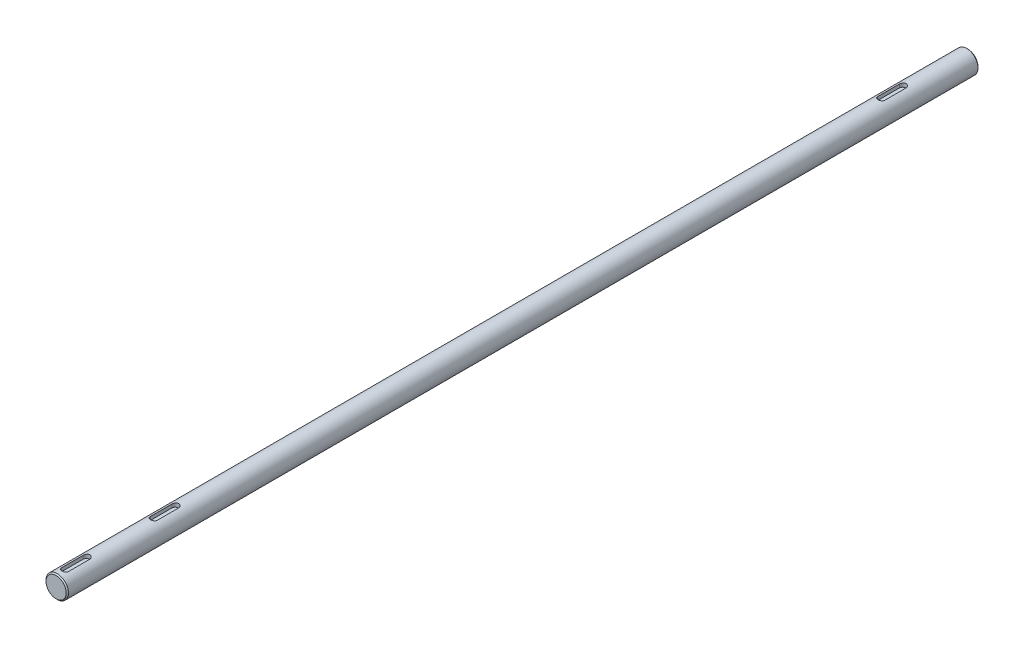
ISO-10303-21;
HEADER;
FILE_DESCRIPTION(('STEP AP214'),'2;1');
FILE_NAME('part.step','',(''),(''),'','','');
FILE_SCHEMA(('AUTOMOTIVE_DESIGN { 1 0 10303 214 1 1 1 1 }'));
ENDSEC;
DATA;
#1=APPLICATION_CONTEXT('core data for automotive mechanical design processes');
#2=APPLICATION_PROTOCOL_DEFINITION('international standard','automotive_design',2000,#1);
#3=PRODUCT_CONTEXT('',#1,'mechanical');
#4=PRODUCT('Part','Part','',(#3));
#5=PRODUCT_RELATED_PRODUCT_CATEGORY('part','',(#4));
#6=PRODUCT_DEFINITION_FORMATION('','',#4);
#7=PRODUCT_DEFINITION_CONTEXT('part definition',#1,'design');
#8=PRODUCT_DEFINITION('design','',#6,#7);
#9=PRODUCT_DEFINITION_SHAPE('','',#8);
#10=(LENGTH_UNIT() NAMED_UNIT(*) SI_UNIT(.MILLI.,.METRE.));
#11=(NAMED_UNIT(*) PLANE_ANGLE_UNIT() SI_UNIT($,.RADIAN.));
#12=(NAMED_UNIT(*) SI_UNIT($,.STERADIAN.) SOLID_ANGLE_UNIT());
#13=UNCERTAINTY_MEASURE_WITH_UNIT(LENGTH_MEASURE(1.E-05),#10,'distance_accuracy_value','');
#14=(GEOMETRIC_REPRESENTATION_CONTEXT(3) GLOBAL_UNCERTAINTY_ASSIGNED_CONTEXT((#13)) GLOBAL_UNIT_ASSIGNED_CONTEXT((#10,
#11,#12)) REPRESENTATION_CONTEXT('',''));
#15=CARTESIAN_POINT('',(0.,0.,0.));
#16=DIRECTION('',(0.,0.,1.));
#17=DIRECTION('',(1.,0.,0.));
#18=AXIS2_PLACEMENT_3D('',#15,#16,#17);
#19=CARTESIAN_POINT('',(-2.22044604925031E-13,1.66533453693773E-13,405.5));
#20=DIRECTION('',(0.,0.,-1.));
#21=DIRECTION('',(-1.00000000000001,0.,0.));
#22=AXIS2_PLACEMENT_3D('',#19,#20,#21);
#23=CYLINDRICAL_SURFACE('',#22,10.);
#24=DIRECTION('',(0.,0.,-1.));
#25=VECTOR('',#24,1.);
#26=CARTESIAN_POINT('',(2.99999999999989,9.53939201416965,405.5));
#27=LINE('',#26,#25);
#28=CARTESIAN_POINT('',(3.00000000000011,9.53939201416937,-347.5));
#29=VERTEX_POINT('',#28);
#30=CARTESIAN_POINT('',(2.99999999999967,9.53939201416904,-328.5));
#31=VERTEX_POINT('',#30);
#32=EDGE_CURVE('E11',#29,#31,#27,.F.);
#33=ORIENTED_EDGE('',*,*,#32,.T.);
#34=CARTESIAN_POINT('',(2.99999999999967,9.53939201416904,-328.5));
#35=CARTESIAN_POINT('',(3.00001027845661,9.53938054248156,-328.417664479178));
#36=CARTESIAN_POINT('',(2.99661062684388,9.54045772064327,-328.335335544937));
#37=CARTESIAN_POINT('',(2.98307142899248,9.54470412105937,-328.171306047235));
#38=CARTESIAN_POINT('',(2.97293339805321,9.54787287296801,-328.089605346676));
#39=CARTESIAN_POINT('',(2.94603140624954,9.55620668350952,-327.927615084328));
#40=CARTESIAN_POINT('',(2.92928426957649,9.56136667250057,-327.847322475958));
#41=CARTESIAN_POINT('',(2.88932853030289,9.57351626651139,-327.688524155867));
#42=CARTESIAN_POINT('',(2.86611975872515,9.58050591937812,-327.610018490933));
#43=CARTESIAN_POINT('',(2.78708584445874,9.60391637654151,-327.378050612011));
#44=CARTESIAN_POINT('',(2.72181852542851,9.62279007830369,-327.227931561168));
#45=CARTESIAN_POINT('',(2.56815043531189,9.66493213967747,-326.940773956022));
#46=CARTESIAN_POINT('',(2.47973889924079,9.68820254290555,-326.803741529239));
#47=CARTESIAN_POINT('',(2.2792987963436,9.73733650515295,-326.542277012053));
#48=CARTESIAN_POINT('',(2.16666914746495,9.76325505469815,-326.41831512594));
#49=CARTESIAN_POINT('',(1.92227736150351,9.81429628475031,-326.190726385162));
#50=CARTESIAN_POINT('',(1.79051199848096,9.83941883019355,-326.08710296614));
#51=CARTESIAN_POINT('',(1.50821997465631,9.88666477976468,-325.901073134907));
#52=CARTESIAN_POINT('',(1.35736167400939,9.90871541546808,-325.819149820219));
#53=CARTESIAN_POINT('',(1.04324233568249,9.94668940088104,-325.682022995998));
#54=CARTESIAN_POINT('',(0.879984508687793,9.96261433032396,-325.626812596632));
#55=CARTESIAN_POINT('',(0.550649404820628,9.98615279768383,-325.546240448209));
#56=CARTESIAN_POINT('',(0.38478625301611,9.99399098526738,-325.520070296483));
#57=CARTESIAN_POINT('',(0.0508471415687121,10.0012640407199,-325.495765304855));
#58=CARTESIAN_POINT('',(-0.11722839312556,10.000700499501,-325.497625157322));
#59=CARTESIAN_POINT('',(-0.445143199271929,9.99139205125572,-325.528785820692));
#60=CARTESIAN_POINT('',(-0.605074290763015,9.98290831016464,-325.557210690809));
#61=CARTESIAN_POINT('',(-0.917780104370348,9.95903027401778,-325.639263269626));
#62=CARTESIAN_POINT('',(-1.07055445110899,9.94363561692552,-325.692892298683));
#63=CARTESIAN_POINT('',(-1.36669563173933,9.90730429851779,-325.824424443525));
#64=CARTESIAN_POINT('',(-1.50993201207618,9.88630511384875,-325.902603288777));
#65=CARTESIAN_POINT('',(-1.78153105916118,9.84099249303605,-326.080797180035));
#66=CARTESIAN_POINT('',(-1.90989038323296,9.81667831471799,-326.180817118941));
#67=CARTESIAN_POINT('',(-2.15330901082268,9.76623347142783,-326.404383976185));
#68=CARTESIAN_POINT('',(-2.26766702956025,9.74006890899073,-326.528687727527));
#69=CARTESIAN_POINT('',(-2.4741353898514,9.68968430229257,-326.794994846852));
#70=CARTESIAN_POINT('',(-2.56623924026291,9.66546482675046,-326.93700336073));
#71=CARTESIAN_POINT('',(-2.72632814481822,9.62154457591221,-327.2365618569));
#72=CARTESIAN_POINT('',(-2.79406012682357,9.60189192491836,-327.394254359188));
#73=CARTESIAN_POINT('',(-2.90171772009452,9.56991327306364,-327.719449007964));
#74=CARTESIAN_POINT('',(-2.941685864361,9.55757606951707,-327.886935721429));
#75=CARTESIAN_POINT('',(-2.97802407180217,9.5462806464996,-328.129989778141));
#76=CARTESIAN_POINT('',(-2.98626405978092,9.54370312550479,-328.20378146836));
#77=CARTESIAN_POINT('',(-2.99724711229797,9.54025857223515,-328.351702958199));
#78=CARTESIAN_POINT('',(-2.99999825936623,9.53938902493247,-328.425832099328));
#79=CARTESIAN_POINT('',(-3.00000000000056,9.53939201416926,-328.5));
#80=B_SPLINE_CURVE_WITH_KNOTS('',3,(#34,#35,#36,#37,#38,#39,#40,#41,#42,#43,#44,#45,#46,#47,#48,
#49,#50,#51,#52,#53,#54,#55,#56,#57,#58,#59,#60,#61,#62,#63,#64,#65,#66,#67,#68,#69,#70,#71,#72,
#73,#74,#75,#76,#77,#78,#79),.UNSPECIFIED.,.F.,.F.,(4,2,2,2,2,2,2,2,2,2,2,2,2,2,2,2,2,2,2,2,2,2,
4),(0.,0.246918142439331,0.493780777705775,0.740019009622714,0.986263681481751,1.47813347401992,
1.97023245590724,2.47635119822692,2.98255536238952,3.49922810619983,4.0157675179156,
4.51753600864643,5.01920948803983,5.50490358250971,5.99062312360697,6.48200583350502,
6.97349873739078,7.48389234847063,7.9944346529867,8.51013494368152,9.02504345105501,
9.24774267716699,9.47011372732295),.UNSPECIFIED.);
#81=CARTESIAN_POINT('',(-3.00000000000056,9.53939201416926,-328.5));
#82=VERTEX_POINT('',#81);
#83=EDGE_CURVE('E513',#31,#82,#80,.T.);
#84=ORIENTED_EDGE('',*,*,#83,.T.);
#85=DIRECTION('',(0.,0.,-1.));
#86=VECTOR('',#85,1.);
#87=CARTESIAN_POINT('',(-3.00000000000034,9.53939201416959,405.5));
#88=LINE('',#87,#86);
#89=CARTESIAN_POINT('',(-3.00000000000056,9.53939201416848,-347.5));
#90=VERTEX_POINT('',#89);
#91=EDGE_CURVE('E49',#82,#90,#88,.T.);
#92=ORIENTED_EDGE('',*,*,#91,.T.);
#93=CARTESIAN_POINT('',(-3.00000000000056,9.53939201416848,-347.5));
#94=CARTESIAN_POINT('',(-3.00001027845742,9.53938054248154,-347.582335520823));
#95=CARTESIAN_POINT('',(-2.99661062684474,9.54045772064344,-347.664664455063));
#96=CARTESIAN_POINT('',(-2.98307142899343,9.54470412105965,-347.828693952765));
#97=CARTESIAN_POINT('',(-2.97293339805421,9.54787287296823,-347.910394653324));
#98=CARTESIAN_POINT('',(-2.9460314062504,9.55620668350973,-348.072384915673));
#99=CARTESIAN_POINT('',(-2.92928426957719,9.56136667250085,-348.152677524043));
#100=CARTESIAN_POINT('',(-2.88932853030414,9.5735162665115,-348.311475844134));
#101=CARTESIAN_POINT('',(-2.8661197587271,9.58050591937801,-348.389981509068));
#102=CARTESIAN_POINT('',(-2.78708584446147,9.60391637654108,-348.62194938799));
#103=CARTESIAN_POINT('',(-2.72181852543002,9.62279007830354,-348.772068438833));
#104=CARTESIAN_POINT('',(-2.56815043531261,9.66493213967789,-349.059226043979));
#105=CARTESIAN_POINT('',(-2.47973889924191,9.68820254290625,-349.196258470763));
#106=CARTESIAN_POINT('',(-2.27929879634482,9.73733650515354,-349.457722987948));
#107=CARTESIAN_POINT('',(-2.16666914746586,9.76325505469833,-349.581684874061));
#108=CARTESIAN_POINT('',(-1.92227736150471,9.81429628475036,-349.809273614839));
#109=CARTESIAN_POINT('',(-1.79051199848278,9.83941883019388,-349.912897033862));
#110=CARTESIAN_POINT('',(-1.50821997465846,9.88666477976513,-350.098926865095));
#111=CARTESIAN_POINT('',(-1.35736167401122,9.90871541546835,-350.180850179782));
#112=CARTESIAN_POINT('',(-1.04324233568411,9.94668940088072,-350.317977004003));
#113=CARTESIAN_POINT('',(-0.879984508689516,9.96261433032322,-350.373187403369));
#114=CARTESIAN_POINT('',(-0.550649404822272,9.98615279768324,-350.453759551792));
#115=CARTESIAN_POINT('',(-0.384786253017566,9.99399098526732,-350.479929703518));
#116=CARTESIAN_POINT('',(-0.05084714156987,10.0012640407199,-350.504234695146));
#117=CARTESIAN_POINT('',(0.11722839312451,10.0007004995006,-350.502374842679));
#118=CARTESIAN_POINT('',(0.44514319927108,9.99139205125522,-350.471214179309));
#119=CARTESIAN_POINT('',(0.605074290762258,9.98290831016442,-350.442789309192));
#120=CARTESIAN_POINT('',(0.917780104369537,9.95903027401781,-350.360736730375));
#121=CARTESIAN_POINT('',(1.07055445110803,9.94363561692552,-350.307107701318));
#122=CARTESIAN_POINT('',(1.36669563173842,9.9073042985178,-350.175575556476));
#123=CARTESIAN_POINT('',(1.50993201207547,9.88630511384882,-350.097396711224));
#124=CARTESIAN_POINT('',(1.78153105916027,9.84099249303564,-349.919202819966));
#125=CARTESIAN_POINT('',(1.90989038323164,9.81667831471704,-349.81918288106));
#126=CARTESIAN_POINT('',(2.15330901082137,9.76623347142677,-349.595616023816));
#127=CARTESIAN_POINT('',(2.26766702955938,9.74006890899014,-349.471312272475));
#128=CARTESIAN_POINT('',(2.47413538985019,9.6896843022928,-349.20500515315));
#129=CARTESIAN_POINT('',(2.5662392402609,9.66546482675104,-349.062996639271));
#130=CARTESIAN_POINT('',(2.72632814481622,9.62154457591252,-348.7634381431));
#131=CARTESIAN_POINT('',(2.79406012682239,9.60189192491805,-348.605745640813));
#132=CARTESIAN_POINT('',(2.90171772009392,9.56991327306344,-348.280550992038));
#133=CARTESIAN_POINT('',(2.94168586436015,9.55757606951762,-348.113064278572));
#134=CARTESIAN_POINT('',(2.97802407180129,9.54628064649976,-347.87001022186));
#135=CARTESIAN_POINT('',(2.98626405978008,9.54370312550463,-347.796218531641));
#136=CARTESIAN_POINT('',(2.99724711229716,9.54025857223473,-347.648297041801));
#137=CARTESIAN_POINT('',(2.99999825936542,9.5393890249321,-347.574167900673));
#138=CARTESIAN_POINT('',(2.99999999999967,9.53939201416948,-347.5));
#139=B_SPLINE_CURVE_WITH_KNOTS('',3,(#93,#94,#95,#96,#97,#98,#99,#100,#101,#102,#103,#104,#105,
#106,#107,#108,#109,#110,#111,#112,#113,#114,#115,#116,#117,#118,#119,#120,#121,#122,#123,#124,
#125,#126,#127,#128,#129,#130,#131,#132,#133,#134,#135,#136,#137,#138),.UNSPECIFIED.,.F.,.F.,(4,
2,2,2,2,2,2,2,2,2,2,2,2,2,2,2,2,2,2,2,2,2,4),(0.,0.246918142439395,0.493780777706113,
0.740019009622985,0.9862636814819,1.47813347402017,1.97023245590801,2.47635119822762,
2.98255536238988,3.49922810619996,4.0157675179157,4.51753600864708,5.01920948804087,
5.50490358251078,5.99062312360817,6.48200583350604,6.97349873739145,7.48389234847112,
7.99443465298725,8.51013494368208,9.02504345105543,9.24774267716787,9.47011372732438),.UNSPECIFIED.);
#140=EDGE_CURVE('E56',#90,#29,#139,.T.);
#141=ORIENTED_EDGE('',*,*,#140,.T.);
#142=EDGE_LOOP('',(#33,#84,#92,#141));
#143=FACE_BOUND('',#142,.T.);
#144=DIRECTION('',(0.,0.,-1.));
#145=VECTOR('',#144,1.);
#146=CARTESIAN_POINT('',(-3.00000000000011,9.53939201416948,405.5));
#147=LINE('',#146,#145);
#148=CARTESIAN_POINT('',(-3.00000000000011,9.53939201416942,318.5));
#149=VERTEX_POINT('',#148);
#150=CARTESIAN_POINT('',(-3.00000000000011,9.53939201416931,299.5));
#151=VERTEX_POINT('',#150);
#152=EDGE_CURVE('E307',#149,#151,#147,.T.);
#153=ORIENTED_EDGE('',*,*,#152,.T.);
#154=CARTESIAN_POINT('',(-3.00000000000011,9.53939201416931,299.5));
#155=CARTESIAN_POINT('',(-3.00001027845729,9.53938054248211,299.417664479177));
#156=CARTESIAN_POINT('',(-2.9966106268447,9.54045772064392,299.335335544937));
#157=CARTESIAN_POINT('',(-2.98307142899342,9.54470412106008,299.171306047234));
#158=CARTESIAN_POINT('',(-2.97293339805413,9.54787287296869,299.089605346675));
#159=CARTESIAN_POINT('',(-2.94603140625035,9.5562066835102,298.927615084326));
#160=CARTESIAN_POINT('',(-2.92928426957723,9.56136667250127,298.847322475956));
#161=CARTESIAN_POINT('',(-2.88932853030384,9.57351626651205,298.688524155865));
#162=CARTESIAN_POINT('',(-2.86611975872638,9.58050591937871,298.610018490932));
#163=CARTESIAN_POINT('',(-2.78708584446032,9.60391637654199,298.378050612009));
#164=CARTESIAN_POINT('',(-2.72181852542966,9.62279007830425,298.227931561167));
#165=CARTESIAN_POINT('',(-2.56815043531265,9.6649321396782,297.940773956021));
#166=CARTESIAN_POINT('',(-2.47973889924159,9.68820254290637,297.803741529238));
#167=CARTESIAN_POINT('',(-2.27929879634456,9.7373365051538,297.542277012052));
#168=CARTESIAN_POINT('',(-2.166669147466,9.76325505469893,297.418315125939));
#169=CARTESIAN_POINT('',(-1.92227736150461,9.81429628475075,297.190726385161));
#170=CARTESIAN_POINT('',(-1.79051199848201,9.83941883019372,297.087102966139));
#171=CARTESIAN_POINT('',(-1.50821997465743,9.88666477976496,296.901073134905));
#172=CARTESIAN_POINT('',(-1.35736167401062,9.90871541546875,296.819149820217));
#173=CARTESIAN_POINT('',(-1.04324233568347,9.94668940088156,296.682022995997));
#174=CARTESIAN_POINT('',(-0.879984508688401,9.96261433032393,296.626812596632));
#175=CARTESIAN_POINT('',(-0.550649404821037,9.98615279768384,296.546240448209));
#176=CARTESIAN_POINT('',(-0.384786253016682,9.99399098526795,296.520070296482));
#177=CARTESIAN_POINT('',(-0.0508471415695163,10.0012640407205,296.495765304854));
#178=CARTESIAN_POINT('',(0.117228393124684,10.0007004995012,296.497625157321));
#179=CARTESIAN_POINT('',(0.445143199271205,9.9913920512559,296.528785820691));
#180=CARTESIAN_POINT('',(0.605074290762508,9.98290831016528,296.557210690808));
#181=CARTESIAN_POINT('',(0.917780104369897,9.95903027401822,296.639263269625));
#182=CARTESIAN_POINT('',(1.07055445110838,9.94363561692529,296.692892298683));
#183=CARTESIAN_POINT('',(1.36669563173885,9.9073042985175,296.824424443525));
#184=CARTESIAN_POINT('',(1.50993201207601,9.8863051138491,296.902603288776));
#185=CARTESIAN_POINT('',(1.78153105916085,9.84099249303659,297.080797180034));
#186=CARTESIAN_POINT('',(1.90989038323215,9.81667831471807,297.180817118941));
#187=CARTESIAN_POINT('',(2.1533090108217,9.76623347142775,297.404383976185));
#188=CARTESIAN_POINT('',(2.26766702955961,9.74006890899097,297.528687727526));
#189=CARTESIAN_POINT('',(2.47413538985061,9.68968430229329,297.794994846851));
#190=CARTESIAN_POINT('',(2.56623924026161,9.66546482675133,297.93700336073));
#191=CARTESIAN_POINT('',(2.7263281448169,9.621544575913,298.2365618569));
#192=CARTESIAN_POINT('',(2.79406012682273,9.60189192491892,298.394254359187));
#193=CARTESIAN_POINT('',(2.90171772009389,9.56991327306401,298.719449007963));
#194=CARTESIAN_POINT('',(2.9416858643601,9.5575760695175,298.886935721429));
#195=CARTESIAN_POINT('',(2.97802407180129,9.54628064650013,299.12998977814));
#196=CARTESIAN_POINT('',(2.9862640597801,9.54370312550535,299.203781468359));
#197=CARTESIAN_POINT('',(2.9972471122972,9.54025857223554,299.351702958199));
#198=CARTESIAN_POINT('',(2.99999825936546,9.53938902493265,299.425832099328));
#199=CARTESIAN_POINT('',(2.99999999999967,9.53939201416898,299.5));
#200=B_SPLINE_CURVE_WITH_KNOTS('',3,(#154,#155,#156,#157,#158,#159,#160,#161,#162,#163,#164,
#165,#166,#167,#168,#169,#170,#171,#172,#173,#174,#175,#176,#177,#178,#179,#180,#181,#182,#183,
#184,#185,#186,#187,#188,#189,#190,#191,#192,#193,#194,#195,#196,#197,#198,#199),.UNSPECIFIED.,
.F.,.F.,(4,2,2,2,2,2,2,2,2,2,2,2,2,2,2,2,2,2,2,2,2,2,4),(0.,0.24691814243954,0.493780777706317,
0.740019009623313,0.986263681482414,1.47813347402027,1.97023245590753,2.47635119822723,
2.9825553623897,3.49922810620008,4.01576751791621,4.517536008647,5.01920948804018,
5.50490358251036,5.99062312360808,6.48200583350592,6.97349873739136,7.48389234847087,
7.99443465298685,8.51013494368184,9.02504345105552,9.24774267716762,9.47011372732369),.UNSPECIFIED.);
#201=CARTESIAN_POINT('',(2.99999999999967,9.53939201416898,299.5));
#202=VERTEX_POINT('',#201);
#203=EDGE_CURVE('E318',#151,#202,#200,.T.);
#204=ORIENTED_EDGE('',*,*,#203,.T.);
#205=DIRECTION('',(0.,0.,-1.));
#206=VECTOR('',#205,1.);
#207=CARTESIAN_POINT('',(2.99999999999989,9.53939201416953,405.5));
#208=LINE('',#207,#206);
#209=CARTESIAN_POINT('',(2.99999999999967,9.53939201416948,318.5));
#210=VERTEX_POINT('',#209);
#211=EDGE_CURVE('E528',#202,#210,#208,.F.);
#212=ORIENTED_EDGE('',*,*,#211,.T.);
#213=CARTESIAN_POINT('',(2.99999999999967,9.53939201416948,318.5));
#214=CARTESIAN_POINT('',(3.00001027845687,9.53938054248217,318.582335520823));
#215=CARTESIAN_POINT('',(2.9966106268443,9.54045772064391,318.664664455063));
#216=CARTESIAN_POINT('',(2.98307142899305,9.54470412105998,318.828693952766));
#217=CARTESIAN_POINT('',(2.97293339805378,9.5478728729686,318.910394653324));
#218=CARTESIAN_POINT('',(2.94603140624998,9.55620668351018,319.072384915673));
#219=CARTESIAN_POINT('',(2.92928426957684,9.56136667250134,319.152677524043));
#220=CARTESIAN_POINT('',(2.88932853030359,9.57351626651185,319.311475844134));
#221=CARTESIAN_POINT('',(2.8661197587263,9.58050591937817,319.389981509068));
#222=CARTESIAN_POINT('',(2.78708584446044,9.60391637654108,319.62194938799));
#223=CARTESIAN_POINT('',(2.72181852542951,9.62279007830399,319.772068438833));
#224=CARTESIAN_POINT('',(2.56815043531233,9.6649321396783,320.059226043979));
#225=CARTESIAN_POINT('',(2.47973889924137,9.68820254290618,320.196258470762));
#226=CARTESIAN_POINT('',(2.27929879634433,9.73733650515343,320.457722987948));
#227=CARTESIAN_POINT('',(2.16666914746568,9.76325505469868,320.581684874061));
#228=CARTESIAN_POINT('',(1.92227736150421,9.81429628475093,320.809273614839));
#229=CARTESIAN_POINT('',(1.79051199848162,9.83941883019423,320.912897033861));
#230=CARTESIAN_POINT('',(1.50821997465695,9.88666477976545,321.098926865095));
#231=CARTESIAN_POINT('',(1.35736167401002,9.90871541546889,321.180850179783));
#232=CARTESIAN_POINT('',(1.04324233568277,9.94668940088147,321.317977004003));
#233=CARTESIAN_POINT('',(0.879984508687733,9.96261433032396,321.373187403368));
#234=CARTESIAN_POINT('',(0.550649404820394,9.98615279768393,321.453759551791));
#235=CARTESIAN_POINT('',(0.384786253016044,9.99399098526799,321.479929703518));
#236=CARTESIAN_POINT('',(0.0508471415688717,10.0012640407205,321.504234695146));
#237=CARTESIAN_POINT('',(-0.11722839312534,10.0007004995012,321.502374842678));
#238=CARTESIAN_POINT('',(-0.445143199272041,9.99139205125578,321.471214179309));
#239=CARTESIAN_POINT('',(-0.60507429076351,9.98290831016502,321.442789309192));
#240=CARTESIAN_POINT('',(-0.917780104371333,9.95903027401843,321.360736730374));
#241=CARTESIAN_POINT('',(-1.07055445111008,9.94363561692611,321.307107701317));
#242=CARTESIAN_POINT('',(-1.36669563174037,9.90730429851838,321.175575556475));
#243=CARTESIAN_POINT('',(-1.50993201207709,9.88630511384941,321.097396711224));
#244=CARTESIAN_POINT('',(-1.78153105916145,9.84099249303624,320.919202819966));
#245=CARTESIAN_POINT('',(-1.90989038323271,9.81667831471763,320.819182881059));
#246=CARTESIAN_POINT('',(-2.15330901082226,9.76623347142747,320.595616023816));
#247=CARTESIAN_POINT('',(-2.26766702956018,9.74006890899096,320.471312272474));
#248=CARTESIAN_POINT('',(-2.4741353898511,9.68968430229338,320.205005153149));
#249=CARTESIAN_POINT('',(-2.56623924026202,9.66546482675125,320.06299663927));
#250=CARTESIAN_POINT('',(-2.7263281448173,9.62154457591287,319.7634381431));
#251=CARTESIAN_POINT('',(-2.79406012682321,9.60189192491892,319.605745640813));
#252=CARTESIAN_POINT('',(-2.90171772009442,9.56991327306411,319.280550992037));
#253=CARTESIAN_POINT('',(-2.9416858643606,9.55757606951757,319.113064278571));
#254=CARTESIAN_POINT('',(-2.97802407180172,9.54628064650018,318.87001022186));
#255=CARTESIAN_POINT('',(-2.98626405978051,9.54370312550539,318.796218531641));
#256=CARTESIAN_POINT('',(-2.99724711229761,9.54025857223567,318.648297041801));
#257=CARTESIAN_POINT('',(-2.99999825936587,9.53938902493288,318.574167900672));
#258=CARTESIAN_POINT('',(-3.00000000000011,9.53939201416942,318.5));
#259=B_SPLINE_CURVE_WITH_KNOTS('',3,(#213,#214,#215,#216,#217,#218,#219,#220,#221,#222,#223,
#224,#225,#226,#227,#228,#229,#230,#231,#232,#233,#234,#235,#236,#237,#238,#239,#240,#241,#242,
#243,#244,#245,#246,#247,#248,#249,#250,#251,#252,#253,#254,#255,#256,#257,#258),.UNSPECIFIED.,
.F.,.F.,(4,2,2,2,2,2,2,2,2,2,2,2,2,2,2,2,2,2,2,2,2,2,4),(0.,0.246918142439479,0.493780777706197,
0.740019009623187,0.986263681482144,1.47813347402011,1.97023245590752,2.47635119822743,
2.98255536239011,3.49922810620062,4.01576751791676,4.51753600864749,5.01920948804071,
5.50490358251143,5.99062312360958,6.48200583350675,6.97349873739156,7.4838923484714,
7.99443465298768,8.51013494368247,9.02504345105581,9.24774267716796,9.47011372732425),.UNSPECIFIED.);
#260=EDGE_CURVE('E64',#210,#149,#259,.T.);
#261=ORIENTED_EDGE('',*,*,#260,.T.);
#262=EDGE_LOOP('',(#153,#204,#212,#261));
#263=FACE_BOUND('',#262,.T.);
#264=DIRECTION('',(0.,0.,-1.));
#265=VECTOR('',#264,1.);
#266=CARTESIAN_POINT('',(-3.00000000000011,9.53939201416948,405.5));
#267=LINE('',#266,#265);
#268=CARTESIAN_POINT('',(-3.00000000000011,9.5393920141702,397.5));
#269=VERTEX_POINT('',#268);
#270=CARTESIAN_POINT('',(-3.00000000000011,9.53939201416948,378.5));
#271=VERTEX_POINT('',#270);
#272=EDGE_CURVE('E311',#269,#271,#267,.T.);
#273=ORIENTED_EDGE('',*,*,#272,.T.);
#274=CARTESIAN_POINT('',(-3.00000000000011,9.53939201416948,378.5));
#275=CARTESIAN_POINT('',(-3.00001027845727,9.53938054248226,378.417664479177));
#276=CARTESIAN_POINT('',(-2.9966106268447,9.54045772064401,378.335335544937));
#277=CARTESIAN_POINT('',(-2.98307142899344,9.54470412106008,378.171306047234));
#278=CARTESIAN_POINT('',(-2.97293339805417,9.54787287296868,378.089605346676));
#279=CARTESIAN_POINT('',(-2.94603140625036,9.5562066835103,377.927615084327));
#280=CARTESIAN_POINT('',(-2.92928426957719,9.56136667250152,377.847322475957));
#281=CARTESIAN_POINT('',(-2.88932853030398,9.57351626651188,377.688524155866));
#282=CARTESIAN_POINT('',(-2.86611975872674,9.58050591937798,377.610018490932));
#283=CARTESIAN_POINT('',(-2.7870858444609,9.60391637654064,377.378050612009));
#284=CARTESIAN_POINT('',(-2.7218185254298,9.6227900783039,377.227931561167));
#285=CARTESIAN_POINT('',(-2.56815043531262,9.66493213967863,376.940773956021));
#286=CARTESIAN_POINT('',(-2.47973889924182,9.68820254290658,376.803741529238));
#287=CARTESIAN_POINT('',(-2.27929879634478,9.73733650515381,376.542277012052));
#288=CARTESIAN_POINT('',(-2.16666914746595,9.76325505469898,376.418315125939));
#289=CARTESIAN_POINT('',(-1.92227736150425,9.8142962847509,376.190726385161));
#290=CARTESIAN_POINT('',(-1.79051199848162,9.83941883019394,376.087102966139));
#291=CARTESIAN_POINT('',(-1.50821997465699,9.88666477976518,375.901073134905));
#292=CARTESIAN_POINT('',(-1.35736167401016,9.9087154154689,375.819149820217));
#293=CARTESIAN_POINT('',(-1.04324233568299,9.94668940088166,375.682022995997));
#294=CARTESIAN_POINT('',(-0.879984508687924,9.96261433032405,375.626812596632));
#295=CARTESIAN_POINT('',(-0.55064940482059,9.98615279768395,375.546240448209));
#296=CARTESIAN_POINT('',(-0.38478625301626,9.99399098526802,375.520070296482));
#297=CARTESIAN_POINT('',(-0.0508471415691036,10.0012640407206,375.495765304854));
#298=CARTESIAN_POINT('',(0.117228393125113,10.0007004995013,375.497625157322));
#299=CARTESIAN_POINT('',(0.445143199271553,9.991392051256,375.528785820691));
#300=CARTESIAN_POINT('',(0.60507429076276,9.98290831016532,375.557210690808));
#301=CARTESIAN_POINT('',(0.917780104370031,9.9590302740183,375.639263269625));
#302=CARTESIAN_POINT('',(1.07055445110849,9.94363561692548,375.692892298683));
#303=CARTESIAN_POINT('',(1.36669563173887,9.90730429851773,375.824424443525));
#304=CARTESIAN_POINT('',(1.50993201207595,9.88630511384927,375.902603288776));
#305=CARTESIAN_POINT('',(1.78153105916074,9.84099249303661,376.080797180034));
#306=CARTESIAN_POINT('',(1.90989038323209,9.81667831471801,376.180817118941));
#307=CARTESIAN_POINT('',(2.1533090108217,9.76623347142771,376.404383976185));
#308=CARTESIAN_POINT('',(2.26766702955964,9.74006890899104,376.528687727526));
#309=CARTESIAN_POINT('',(2.47413538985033,9.68968430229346,376.794994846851));
#310=CARTESIAN_POINT('',(2.56623924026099,9.66546482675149,376.93700336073));
#311=CARTESIAN_POINT('',(2.72632814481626,9.62154457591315,377.2365618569));
#312=CARTESIAN_POINT('',(2.7940601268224,9.60189192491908,377.394254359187));
#313=CARTESIAN_POINT('',(2.90171772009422,9.56991327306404,377.719449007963));
#314=CARTESIAN_POINT('',(2.94168586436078,9.55757606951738,377.886935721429));
#315=CARTESIAN_POINT('',(2.97802407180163,9.5462806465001,378.12998977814));
#316=CARTESIAN_POINT('',(2.98626405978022,9.54370312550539,378.203781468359));
#317=CARTESIAN_POINT('',(2.99724711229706,9.54025857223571,378.351702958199));
#318=CARTESIAN_POINT('',(2.99999825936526,9.53938902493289,378.425832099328));
#319=CARTESIAN_POINT('',(2.99999999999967,9.53939201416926,378.5));
#320=B_SPLINE_CURVE_WITH_KNOTS('',3,(#274,#275,#276,#277,#278,#279,#280,#281,#282,#283,#284,
#285,#286,#287,#288,#289,#290,#291,#292,#293,#294,#295,#296,#297,#298,#299,#300,#301,#302,#303,
#304,#305,#306,#307,#308,#309,#310,#311,#312,#313,#314,#315,#316,#317,#318,#319),.UNSPECIFIED.,
.F.,.F.,(4,2,2,2,2,2,2,2,2,2,2,2,2,2,2,2,2,2,2,2,2,2,4),(0.,0.246918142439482,0.493780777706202,
0.740019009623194,0.986263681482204,1.47813347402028,1.97023245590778,2.47635119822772,
2.98255536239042,3.49922810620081,4.0157675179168,4.51753600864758,5.01920948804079,
5.50490358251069,5.99062312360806,6.482005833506,6.97349873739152,7.48389234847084,
7.99443465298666,8.51013494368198,9.02504345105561,9.24774267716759,9.47011372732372),.UNSPECIFIED.);
#321=CARTESIAN_POINT('',(2.99999999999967,9.53939201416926,378.5));
#322=VERTEX_POINT('',#321);
#323=EDGE_CURVE('E249',#271,#322,#320,.T.);
#324=ORIENTED_EDGE('',*,*,#323,.T.);
#325=DIRECTION('',(0.,0.,-1.));
#326=VECTOR('',#325,1.);
#327=CARTESIAN_POINT('',(3.00000000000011,9.5393920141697,405.5));
#328=LINE('',#327,#326);
#329=CARTESIAN_POINT('',(2.99999999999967,9.5393920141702,397.5));
#330=VERTEX_POINT('',#329);
#331=EDGE_CURVE('E319',#322,#330,#328,.F.);
#332=ORIENTED_EDGE('',*,*,#331,.T.);
#333=CARTESIAN_POINT('',(2.99999999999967,9.5393920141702,397.5));
#334=CARTESIAN_POINT('',(3.00001027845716,9.53938054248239,397.582335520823));
#335=CARTESIAN_POINT('',(2.99661062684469,9.54045772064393,397.664664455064));
#336=CARTESIAN_POINT('',(2.98307142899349,9.54470412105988,397.828693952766));
#337=CARTESIAN_POINT('',(2.97293339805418,9.54787287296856,397.910394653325));
#338=CARTESIAN_POINT('',(2.94603140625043,9.55620668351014,398.072384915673));
#339=CARTESIAN_POINT('',(2.92928426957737,9.56136667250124,398.152677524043));
#340=CARTESIAN_POINT('',(2.88932853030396,9.57351626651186,398.311475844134));
#341=CARTESIAN_POINT('',(2.8661197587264,9.58050591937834,398.389981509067));
#342=CARTESIAN_POINT('',(2.78708584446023,9.60391637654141,398.62194938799));
#343=CARTESIAN_POINT('',(2.72181852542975,9.62279007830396,398.772068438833));
#344=CARTESIAN_POINT('',(2.56815043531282,9.6649321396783,399.059226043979));
#345=CARTESIAN_POINT('',(2.47973889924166,9.68820254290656,399.196258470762));
#346=CARTESIAN_POINT('',(2.27929879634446,9.73733650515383,399.457722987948));
#347=CARTESIAN_POINT('',(2.16666914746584,9.76325505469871,399.581684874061));
#348=CARTESIAN_POINT('',(1.92227736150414,9.81429628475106,399.809273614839));
#349=CARTESIAN_POINT('',(1.79051199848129,9.83941883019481,399.912897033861));
#350=CARTESIAN_POINT('',(1.50821997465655,9.88666477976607,400.098926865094));
#351=CARTESIAN_POINT('',(1.35736167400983,9.90871541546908,400.180850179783));
#352=CARTESIAN_POINT('',(1.04324233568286,9.94668940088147,400.317977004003));
#353=CARTESIAN_POINT('',(0.879984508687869,9.96261433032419,400.373187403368));
#354=CARTESIAN_POINT('',(0.550649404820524,9.98615279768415,400.453759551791));
#355=CARTESIAN_POINT('',(0.384786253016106,9.99399098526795,400.479929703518));
#356=CARTESIAN_POINT('',(0.0508471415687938,10.0012640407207,400.504234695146));
#357=CARTESIAN_POINT('',(-0.11722839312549,10.0007004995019,400.502374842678));
#358=CARTESIAN_POINT('',(-0.44514319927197,9.99139205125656,400.471214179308));
#359=CARTESIAN_POINT('',(-0.605074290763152,9.98290831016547,400.442789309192));
#360=CARTESIAN_POINT('',(-0.917780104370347,9.95903027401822,400.360736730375));
#361=CARTESIAN_POINT('',(-1.07055445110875,9.94363561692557,400.307107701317));
#362=CARTESIAN_POINT('',(-1.3666956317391,9.90730429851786,400.175575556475));
#363=CARTESIAN_POINT('',(-1.5099320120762,9.88630511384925,400.097396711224));
#364=CARTESIAN_POINT('',(-1.78153105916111,9.84099249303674,399.919202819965));
#365=CARTESIAN_POINT('',(-1.90989038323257,9.81667831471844,399.819182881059));
#366=CARTESIAN_POINT('',(-2.15330901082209,9.76623347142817,399.595616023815));
#367=CARTESIAN_POINT('',(-2.26766702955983,9.74006890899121,399.471312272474));
#368=CARTESIAN_POINT('',(-2.47413538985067,9.68968430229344,399.205005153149));
#369=CARTESIAN_POINT('',(-2.56623924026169,9.66546482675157,399.06299663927));
#370=CARTESIAN_POINT('',(-2.72632814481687,9.62154457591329,398.7634381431));
#371=CARTESIAN_POINT('',(-2.79406012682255,9.60189192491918,398.605745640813));
#372=CARTESIAN_POINT('',(-2.90171772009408,9.56991327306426,398.280550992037));
#373=CARTESIAN_POINT('',(-2.94168586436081,9.55757606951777,398.113064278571));
#374=CARTESIAN_POINT('',(-2.97802407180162,9.54628064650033,397.87001022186));
#375=CARTESIAN_POINT('',(-2.98626405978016,9.54370312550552,397.796218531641));
#376=CARTESIAN_POINT('',(-2.99724711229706,9.54025857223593,397.648297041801));
#377=CARTESIAN_POINT('',(-2.99999825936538,9.5393890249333,397.574167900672));
#378=CARTESIAN_POINT('',(-3.00000000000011,9.5393920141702,397.5));
#379=B_SPLINE_CURVE_WITH_KNOTS('',3,(#333,#334,#335,#336,#337,#338,#339,#340,#341,#342,#343,
#344,#345,#346,#347,#348,#349,#350,#351,#352,#353,#354,#355,#356,#357,#358,#359,#360,#361,#362,
#363,#364,#365,#366,#367,#368,#369,#370,#371,#372,#373,#374,#375,#376,#377,#378),.UNSPECIFIED.,
.F.,.F.,(4,2,2,2,2,2,2,2,2,2,2,2,2,2,2,2,2,2,2,2,2,2,4),(0.,0.246918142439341,0.493780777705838,
0.740019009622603,0.986263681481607,1.47813347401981,1.9702324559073,2.47635119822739,
2.98255536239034,3.49922810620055,4.01576751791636,4.51753600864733,5.01920948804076,
5.50490358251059,5.99062312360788,6.4820058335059,6.97349873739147,7.48389234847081,
7.99443465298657,8.51013494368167,9.02504345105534,9.24774267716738,9.47011372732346),.UNSPECIFIED.);
#380=EDGE_CURVE('E257',#330,#269,#379,.T.);
#381=ORIENTED_EDGE('',*,*,#380,.T.);
#382=EDGE_LOOP('',(#273,#324,#332,#381));
#383=FACE_BOUND('',#382,.T.);
#384=CARTESIAN_POINT('',(-1.33226762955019E-12,-1.0547118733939E-12,-404.500000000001));
#385=DIRECTION('',(0.,0.,1.));
#386=DIRECTION('',(1.00000000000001,0.,0.));
#387=AXIS2_PLACEMENT_3D('',#384,#385,#386);
#388=CIRCLE('',#387,10.);
#389=CARTESIAN_POINT('',(9.9999999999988,-1.01696429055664E-12,-404.500000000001));
#390=VERTEX_POINT('',#389);
#391=EDGE_CURVE('E237',#390,#390,#388,.T.);
#392=ORIENTED_EDGE('',*,*,#391,.T.);
#393=EDGE_LOOP('',(#392));
#394=FACE_BOUND('',#393,.T.);
#395=CARTESIAN_POINT('',(-2.22044604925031E-13,1.66533453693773E-13,404.500000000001));
#396=DIRECTION('',(0.,0.,1.));
#397=DIRECTION('',(1.00000000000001,0.,0.));
#398=AXIS2_PLACEMENT_3D('',#395,#396,#397);
#399=CIRCLE('',#398,10.);
#400=CARTESIAN_POINT('',(9.99999999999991,2.04281036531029E-13,404.500000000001));
#401=VERTEX_POINT('',#400);
#402=EDGE_CURVE('E222',#401,#401,#399,.F.);
#403=ORIENTED_EDGE('',*,*,#402,.T.);
#404=EDGE_LOOP('',(#403));
#405=FACE_BOUND('',#404,.T.);
#406=ADVANCED_FACE('F40',(#143,#263,#383,#394,#405),#23,.T.);
#407=CARTESIAN_POINT('',(-2.22044604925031E-13,1.66533453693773E-13,405.5));
#408=DIRECTION('',(0.,0.,1.));
#409=DIRECTION('',(1.00000000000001,0.,0.));
#410=AXIS2_PLACEMENT_3D('',#407,#408,#409);
#411=PLANE('',#410);
#412=CARTESIAN_POINT('',(-2.22044604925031E-13,1.66533453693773E-13,405.5));
#413=DIRECTION('',(0.,0.,1.));
#414=DIRECTION('',(1.00000000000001,0.,0.));
#415=AXIS2_PLACEMENT_3D('',#412,#413,#414);
#416=CIRCLE('',#415,9.00000000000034);
#417=CARTESIAN_POINT('',(9.00000000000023,2.00506278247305E-13,405.5));
#418=VERTEX_POINT('',#417);
#419=EDGE_CURVE('E245',#418,#418,#416,.T.);
#420=ORIENTED_EDGE('',*,*,#419,.T.);
#421=EDGE_LOOP('',(#420));
#422=FACE_BOUND('',#421,.T.);
#423=ADVANCED_FACE('F290',(#422),#411,.T.);
#424=CARTESIAN_POINT('',(-1.77635683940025E-12,-8.32667268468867E-13,-405.500000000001));
#425=DIRECTION('',(0.,0.,1.));
#426=DIRECTION('',(1.00000000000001,0.,0.));
#427=AXIS2_PLACEMENT_3D('',#424,#425,#426);
#428=PLANE('',#427);
#429=CARTESIAN_POINT('',(-1.77635683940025E-12,-8.32667268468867E-13,-405.500000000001));
#430=DIRECTION('',(0.,0.,1.));
#431=DIRECTION('',(1.00000000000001,0.,0.));
#432=AXIS2_PLACEMENT_3D('',#429,#430,#431);
#433=CIRCLE('',#432,8.99999999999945);
#434=CARTESIAN_POINT('',(8.99999999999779,-7.9869444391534E-13,-405.500000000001));
#435=VERTEX_POINT('',#434);
#436=EDGE_CURVE('E241',#435,#435,#433,.F.);
#437=ORIENTED_EDGE('',*,*,#436,.T.);
#438=EDGE_LOOP('',(#437));
#439=FACE_BOUND('',#438,.T.);
#440=ADVANCED_FACE('F287',(#439),#428,.F.);
#441=CARTESIAN_POINT('',(-1.33226762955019E-12,-1.0547118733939E-12,-404.500000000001));
#442=DIRECTION('',(0.,0.,1.));
#443=DIRECTION('',(1.00000000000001,0.,0.));
#444=AXIS2_PLACEMENT_3D('',#441,#442,#443);
#445=CONICAL_SURFACE('',#444,10.,0.785398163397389);
#446=ORIENTED_EDGE('',*,*,#436,.F.);
#447=EDGE_LOOP('',(#446));
#448=FACE_BOUND('',#447,.T.);
#449=ORIENTED_EDGE('',*,*,#391,.F.);
#450=EDGE_LOOP('',(#449));
#451=FACE_BOUND('',#450,.T.);
#452=ADVANCED_FACE('F283',(#448,#451),#445,.T.);
#453=CARTESIAN_POINT('',(-2.22044604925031E-13,1.66533453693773E-13,405.5));
#454=DIRECTION('',(0.,0.,-1.));
#455=DIRECTION('',(-1.00000000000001,0.,0.));
#456=AXIS2_PLACEMENT_3D('',#453,#454,#455);
#457=CONICAL_SURFACE('',#456,9.00000000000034,0.785398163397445);
#458=ORIENTED_EDGE('',*,*,#402,.F.);
#459=EDGE_LOOP('',(#458));
#460=FACE_BOUND('',#459,.T.);
#461=ORIENTED_EDGE('',*,*,#419,.F.);
#462=EDGE_LOOP('',(#461));
#463=FACE_BOUND('',#462,.T.);
#464=ADVANCED_FACE('F279',(#460,#463),#457,.T.);
#465=CARTESIAN_POINT('',(0.,6.50000000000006,397.5));
#466=DIRECTION('',(0.,1.,0.));
#467=DIRECTION('',(-1.00000000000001,0.,0.));
#468=AXIS2_PLACEMENT_3D('',#465,#466,#467);
#469=CYLINDRICAL_SURFACE('',#468,3.);
#470=DIRECTION('',(0.,1.,0.));
#471=VECTOR('',#470,1.);
#472=CARTESIAN_POINT('',(3.00000000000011,6.50000000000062,397.5));
#473=LINE('',#472,#471);
#474=CARTESIAN_POINT('',(3.00000000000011,6.50000000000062,397.5));
#475=VERTEX_POINT('',#474);
#476=EDGE_CURVE('E217',#475,#330,#473,.T.);
#477=ORIENTED_EDGE('',*,*,#476,.F.);
#478=CARTESIAN_POINT('',(0.,6.50000000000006,397.5));
#479=DIRECTION('',(0.,1.,0.));
#480=DIRECTION('',(-1.00000000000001,0.,0.));
#481=AXIS2_PLACEMENT_3D('',#478,#479,#480);
#482=CIRCLE('',#481,3.);
#483=CARTESIAN_POINT('',(-2.99999999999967,6.50000000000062,397.5));
#484=VERTEX_POINT('',#483);
#485=EDGE_CURVE('E191',#484,#475,#482,.T.);
#486=ORIENTED_EDGE('',*,*,#485,.F.);
#487=DIRECTION('',(0.,1.,0.));
#488=VECTOR('',#487,1.);
#489=CARTESIAN_POINT('',(-2.99999999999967,6.50000000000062,397.5));
#490=LINE('',#489,#488);
#491=EDGE_CURVE('E218',#484,#269,#490,.T.);
#492=ORIENTED_EDGE('',*,*,#491,.T.);
#493=ORIENTED_EDGE('',*,*,#380,.F.);
#494=EDGE_LOOP('',(#477,#486,#492,#493));
#495=FACE_BOUND('',#494,.T.);
#496=ADVANCED_FACE('F275',(#495),#469,.F.);
#497=CARTESIAN_POINT('',(-3.00000000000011,6.4999999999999,378.5));
#498=DIRECTION('',(-1.00000000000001,0.,0.));
#499=DIRECTION('',(0.,0.,1.));
#500=AXIS2_PLACEMENT_3D('',#497,#498,#499);
#501=PLANE('',#500);
#502=ORIENTED_EDGE('',*,*,#491,.F.);
#503=DIRECTION('',(0.,0.,1.));
#504=VECTOR('',#503,1.);
#505=CARTESIAN_POINT('',(-3.00000000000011,6.4999999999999,378.5));
#506=LINE('',#505,#504);
#507=CARTESIAN_POINT('',(-3.00000000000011,6.4999999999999,378.5));
#508=VERTEX_POINT('',#507);
#509=EDGE_CURVE('E213',#508,#484,#506,.T.);
#510=ORIENTED_EDGE('',*,*,#509,.F.);
#511=DIRECTION('',(0.,1.,0.));
#512=VECTOR('',#511,1.);
#513=CARTESIAN_POINT('',(-3.00000000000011,6.4999999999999,378.5));
#514=LINE('',#513,#512);
#515=EDGE_CURVE('E223',#508,#271,#514,.T.);
#516=ORIENTED_EDGE('',*,*,#515,.T.);
#517=ORIENTED_EDGE('',*,*,#272,.F.);
#518=EDGE_LOOP('',(#502,#510,#516,#517));
#519=FACE_BOUND('',#518,.T.);
#520=ADVANCED_FACE('F269',(#519),#501,.F.);
#521=CARTESIAN_POINT('',(0.,6.50000000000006,378.5));
#522=DIRECTION('',(0.,1.,0.));
#523=DIRECTION('',(-1.00000000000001,0.,0.));
#524=AXIS2_PLACEMENT_3D('',#521,#522,#523);
#525=CYLINDRICAL_SURFACE('',#524,3.);
#526=ORIENTED_EDGE('',*,*,#515,.F.);
#527=CARTESIAN_POINT('',(0.,6.50000000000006,378.5));
#528=DIRECTION('',(0.,1.,0.));
#529=DIRECTION('',(-1.00000000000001,0.,0.));
#530=AXIS2_PLACEMENT_3D('',#527,#528,#529);
#531=CIRCLE('',#530,3.);
#532=CARTESIAN_POINT('',(3.00000000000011,6.49999999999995,378.5));
#533=VERTEX_POINT('',#532);
#534=EDGE_CURVE('E209',#533,#508,#531,.T.);
#535=ORIENTED_EDGE('',*,*,#534,.F.);
#536=DIRECTION('',(0.,1.,0.));
#537=VECTOR('',#536,1.);
#538=CARTESIAN_POINT('',(3.00000000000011,6.49999999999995,378.5));
#539=LINE('',#538,#537);
#540=EDGE_CURVE('E227',#533,#322,#539,.T.);
#541=ORIENTED_EDGE('',*,*,#540,.T.);
#542=ORIENTED_EDGE('',*,*,#323,.F.);
#543=EDGE_LOOP('',(#526,#535,#541,#542));
#544=FACE_BOUND('',#543,.T.);
#545=ADVANCED_FACE('F263',(#544),#525,.F.);
#546=CARTESIAN_POINT('',(3.00000000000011,6.50000000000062,397.5));
#547=DIRECTION('',(1.00000000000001,0.,0.));
#548=DIRECTION('',(0.,1.,0.));
#549=AXIS2_PLACEMENT_3D('',#546,#547,#548);
#550=PLANE('',#549);
#551=ORIENTED_EDGE('',*,*,#540,.F.);
#552=DIRECTION('',(0.,0.,-1.));
#553=VECTOR('',#552,1.);
#554=CARTESIAN_POINT('',(3.00000000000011,6.50000000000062,397.5));
#555=LINE('',#554,#553);
#556=EDGE_CURVE('E205',#475,#533,#555,.T.);
#557=ORIENTED_EDGE('',*,*,#556,.F.);
#558=ORIENTED_EDGE('',*,*,#476,.T.);
#559=ORIENTED_EDGE('',*,*,#331,.F.);
#560=EDGE_LOOP('',(#551,#557,#558,#559));
#561=FACE_BOUND('',#560,.T.);
#562=ADVANCED_FACE('F268',(#561),#550,.F.);
#563=CARTESIAN_POINT('',(0.,6.50000000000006,397.5));
#564=DIRECTION('',(0.,1.,0.));
#565=DIRECTION('',(-1.00000000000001,0.,0.));
#566=AXIS2_PLACEMENT_3D('',#563,#564,#565);
#567=PLANE('',#566);
#568=ORIENTED_EDGE('',*,*,#485,.T.);
#569=ORIENTED_EDGE('',*,*,#556,.T.);
#570=ORIENTED_EDGE('',*,*,#534,.T.);
#571=ORIENTED_EDGE('',*,*,#509,.T.);
#572=EDGE_LOOP('',(#568,#569,#570,#571));
#573=FACE_BOUND('',#572,.T.);
#574=ADVANCED_FACE('F273',(#573),#567,.T.);
#575=CARTESIAN_POINT('',(-4.44089209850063E-13,6.4999999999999,318.5));
#576=DIRECTION('',(0.,1.,0.));
#577=DIRECTION('',(-1.00000000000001,0.,0.));
#578=AXIS2_PLACEMENT_3D('',#575,#576,#577);
#579=CYLINDRICAL_SURFACE('',#578,3.);
#580=DIRECTION('',(0.,1.,0.));
#581=VECTOR('',#580,1.);
#582=CARTESIAN_POINT('',(2.99999999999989,6.50000000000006,318.5));
#583=LINE('',#582,#581);
#584=CARTESIAN_POINT('',(2.99999999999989,6.50000000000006,318.5));
#585=VERTEX_POINT('',#584);
#586=EDGE_CURVE('E187',#585,#210,#583,.T.);
#587=ORIENTED_EDGE('',*,*,#586,.F.);
#588=CARTESIAN_POINT('',(-4.44089209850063E-13,6.4999999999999,318.5));
#589=DIRECTION('',(0.,1.,0.));
#590=DIRECTION('',(-1.00000000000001,0.,0.));
#591=AXIS2_PLACEMENT_3D('',#588,#589,#590);
#592=CIRCLE('',#591,3.);
#593=CARTESIAN_POINT('',(-3.00000000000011,6.4999999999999,318.5));
#594=VERTEX_POINT('',#593);
#595=EDGE_CURVE('E166',#594,#585,#592,.T.);
#596=ORIENTED_EDGE('',*,*,#595,.F.);
#597=DIRECTION('',(0.,1.,0.));
#598=VECTOR('',#597,1.);
#599=CARTESIAN_POINT('',(-3.00000000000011,6.4999999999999,318.5));
#600=LINE('',#599,#598);
#601=EDGE_CURVE('E188',#594,#149,#600,.T.);
#602=ORIENTED_EDGE('',*,*,#601,.T.);
#603=ORIENTED_EDGE('',*,*,#260,.F.);
#604=EDGE_LOOP('',(#587,#596,#602,#603));
#605=FACE_BOUND('',#604,.T.);
#606=ADVANCED_FACE('F347',(#605),#579,.F.);
#607=CARTESIAN_POINT('',(-3.00000000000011,6.49999999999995,299.5));
#608=DIRECTION('',(-1.00000000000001,0.,0.));
#609=DIRECTION('',(0.,-1.,0.));
#610=AXIS2_PLACEMENT_3D('',#607,#608,#609);
#611=PLANE('',#610);
#612=ORIENTED_EDGE('',*,*,#601,.F.);
#613=DIRECTION('',(0.,0.,1.));
#614=VECTOR('',#613,1.);
#615=CARTESIAN_POINT('',(-3.00000000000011,6.49999999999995,299.5));
#616=LINE('',#615,#614);
#617=CARTESIAN_POINT('',(-3.00000000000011,6.49999999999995,299.5));
#618=VERTEX_POINT('',#617);
#619=EDGE_CURVE('E183',#618,#594,#616,.T.);
#620=ORIENTED_EDGE('',*,*,#619,.F.);
#621=DIRECTION('',(0.,1.,0.));
#622=VECTOR('',#621,1.);
#623=CARTESIAN_POINT('',(-3.00000000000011,6.49999999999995,299.5));
#624=LINE('',#623,#622);
#625=EDGE_CURVE('E192',#618,#151,#624,.T.);
#626=ORIENTED_EDGE('',*,*,#625,.T.);
#627=ORIENTED_EDGE('',*,*,#152,.F.);
#628=EDGE_LOOP('',(#612,#620,#626,#627));
#629=FACE_BOUND('',#628,.T.);
#630=ADVANCED_FACE('F341',(#629),#611,.F.);
#631=CARTESIAN_POINT('',(0.,6.50000000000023,299.5));
#632=DIRECTION('',(0.,1.,0.));
#633=DIRECTION('',(-1.00000000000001,0.,0.));
#634=AXIS2_PLACEMENT_3D('',#631,#632,#633);
#635=CYLINDRICAL_SURFACE('',#634,3.);
#636=ORIENTED_EDGE('',*,*,#625,.F.);
#637=CARTESIAN_POINT('',(0.,6.50000000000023,299.5));
#638=DIRECTION('',(0.,1.,0.));
#639=DIRECTION('',(-1.00000000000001,0.,0.));
#640=AXIS2_PLACEMENT_3D('',#637,#638,#639);
#641=CIRCLE('',#640,3.);
#642=CARTESIAN_POINT('',(2.99999999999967,6.49999999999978,299.5));
#643=VERTEX_POINT('',#642);
#644=EDGE_CURVE('E179',#643,#618,#641,.T.);
#645=ORIENTED_EDGE('',*,*,#644,.F.);
#646=DIRECTION('',(0.,1.,0.));
#647=VECTOR('',#646,1.);
#648=CARTESIAN_POINT('',(2.99999999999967,6.49999999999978,299.5));
#649=LINE('',#648,#647);
#650=EDGE_CURVE('E196',#643,#202,#649,.T.);
#651=ORIENTED_EDGE('',*,*,#650,.T.);
#652=ORIENTED_EDGE('',*,*,#203,.F.);
#653=EDGE_LOOP('',(#636,#645,#651,#652));
#654=FACE_BOUND('',#653,.T.);
#655=ADVANCED_FACE('F335',(#654),#635,.F.);
#656=CARTESIAN_POINT('',(2.99999999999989,6.50000000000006,318.5));
#657=DIRECTION('',(1.00000000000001,0.,0.));
#658=DIRECTION('',(0.,1.,0.));
#659=AXIS2_PLACEMENT_3D('',#656,#657,#658);
#660=PLANE('',#659);
#661=ORIENTED_EDGE('',*,*,#650,.F.);
#662=DIRECTION('',(0.,0.,-1.));
#663=VECTOR('',#662,1.);
#664=CARTESIAN_POINT('',(2.99999999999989,6.50000000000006,318.5));
#665=LINE('',#664,#663);
#666=EDGE_CURVE('E175',#585,#643,#665,.T.);
#667=ORIENTED_EDGE('',*,*,#666,.F.);
#668=ORIENTED_EDGE('',*,*,#586,.T.);
#669=ORIENTED_EDGE('',*,*,#211,.F.);
#670=EDGE_LOOP('',(#661,#667,#668,#669));
#671=FACE_BOUND('',#670,.T.);
#672=ADVANCED_FACE('F340',(#671),#660,.F.);
#673=CARTESIAN_POINT('',(-4.44089209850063E-13,6.4999999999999,318.5));
#674=DIRECTION('',(0.,1.,0.));
#675=DIRECTION('',(-1.00000000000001,0.,0.));
#676=AXIS2_PLACEMENT_3D('',#673,#674,#675);
#677=PLANE('',#676);
#678=ORIENTED_EDGE('',*,*,#595,.T.);
#679=ORIENTED_EDGE('',*,*,#666,.T.);
#680=ORIENTED_EDGE('',*,*,#644,.T.);
#681=ORIENTED_EDGE('',*,*,#619,.T.);
#682=EDGE_LOOP('',(#678,#679,#680,#681));
#683=FACE_BOUND('',#682,.T.);
#684=ADVANCED_FACE('F345',(#683),#677,.T.);
#685=CARTESIAN_POINT('',(0.,6.49999999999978,-347.5));
#686=DIRECTION('',(0.,1.,0.));
#687=DIRECTION('',(-1.00000000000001,0.,0.));
#688=AXIS2_PLACEMENT_3D('',#685,#686,#687);
#689=CYLINDRICAL_SURFACE('',#688,3.);
#690=DIRECTION('',(0.,1.,0.));
#691=VECTOR('',#690,1.);
#692=CARTESIAN_POINT('',(-3.00000000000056,6.49999999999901,-347.5));
#693=LINE('',#692,#691);
#694=CARTESIAN_POINT('',(-3.00000000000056,6.49999999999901,-347.5));
#695=VERTEX_POINT('',#694);
#696=EDGE_CURVE('E130',#695,#90,#693,.T.);
#697=ORIENTED_EDGE('',*,*,#696,.F.);
#698=CARTESIAN_POINT('',(0.,6.49999999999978,-347.5));
#699=DIRECTION('',(0.,1.,0.));
#700=DIRECTION('',(-1.00000000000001,0.,0.));
#701=AXIS2_PLACEMENT_3D('',#698,#699,#700);
#702=CIRCLE('',#701,3.);
#703=CARTESIAN_POINT('',(2.99999999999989,6.50000000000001,-347.5));
#704=VERTEX_POINT('',#703);
#705=EDGE_CURVE('E134',#704,#695,#702,.T.);
#706=ORIENTED_EDGE('',*,*,#705,.F.);
#707=DIRECTION('',(0.,1.,0.));
#708=VECTOR('',#707,1.);
#709=CARTESIAN_POINT('',(2.99999999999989,6.50000000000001,-347.5));
#710=LINE('',#709,#708);
#711=EDGE_CURVE('E163',#704,#29,#710,.T.);
#712=ORIENTED_EDGE('',*,*,#711,.T.);
#713=ORIENTED_EDGE('',*,*,#140,.F.);
#714=EDGE_LOOP('',(#697,#706,#712,#713));
#715=FACE_BOUND('',#714,.T.);
#716=ADVANCED_FACE('F132',(#715),#689,.F.);
#717=CARTESIAN_POINT('',(2.99999999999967,6.49999999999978,-328.5));
#718=DIRECTION('',(1.00000000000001,0.,0.));
#719=DIRECTION('',(0.,0.,-1.));
#720=AXIS2_PLACEMENT_3D('',#717,#718,#719);
#721=PLANE('',#720);
#722=ORIENTED_EDGE('',*,*,#711,.F.);
#723=DIRECTION('',(0.,0.,-1.));
#724=VECTOR('',#723,1.);
#725=CARTESIAN_POINT('',(2.99999999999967,6.49999999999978,-328.5));
#726=LINE('',#725,#724);
#727=CARTESIAN_POINT('',(2.99999999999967,6.49999999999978,-328.5));
#728=VERTEX_POINT('',#727);
#729=EDGE_CURVE('E140',#728,#704,#726,.T.);
#730=ORIENTED_EDGE('',*,*,#729,.F.);
#731=DIRECTION('',(0.,1.,0.));
#732=VECTOR('',#731,1.);
#733=CARTESIAN_POINT('',(2.99999999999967,6.49999999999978,-328.5));
#734=LINE('',#733,#732);
#735=EDGE_CURVE('E167',#728,#31,#734,.T.);
#736=ORIENTED_EDGE('',*,*,#735,.T.);
#737=ORIENTED_EDGE('',*,*,#32,.F.);
#738=EDGE_LOOP('',(#722,#730,#736,#737));
#739=FACE_BOUND('',#738,.T.);
#740=ADVANCED_FACE('F408',(#739),#721,.F.);
#741=CARTESIAN_POINT('',(-8.88178419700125E-13,6.49999999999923,-328.500000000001));
#742=DIRECTION('',(0.,1.,0.));
#743=DIRECTION('',(-1.00000000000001,0.,0.));
#744=AXIS2_PLACEMENT_3D('',#741,#742,#743);
#745=CYLINDRICAL_SURFACE('',#744,3.);
#746=ORIENTED_EDGE('',*,*,#735,.F.);
#747=CARTESIAN_POINT('',(-8.88178419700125E-13,6.49999999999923,-328.500000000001));
#748=DIRECTION('',(0.,1.,0.));
#749=DIRECTION('',(-1.00000000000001,0.,0.));
#750=AXIS2_PLACEMENT_3D('',#747,#748,#749);
#751=CIRCLE('',#750,3.);
#752=CARTESIAN_POINT('',(-3.00000000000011,6.4999999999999,-328.5));
#753=VERTEX_POINT('',#752);
#754=EDGE_CURVE('E150',#753,#728,#751,.T.);
#755=ORIENTED_EDGE('',*,*,#754,.F.);
#756=DIRECTION('',(0.,1.,0.));
#757=VECTOR('',#756,1.);
#758=CARTESIAN_POINT('',(-3.00000000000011,6.4999999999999,-328.5));
#759=LINE('',#758,#757);
#760=EDGE_CURVE('E139',#753,#82,#759,.T.);
#761=ORIENTED_EDGE('',*,*,#760,.T.);
#762=ORIENTED_EDGE('',*,*,#83,.F.);
#763=EDGE_LOOP('',(#746,#755,#761,#762));
#764=FACE_BOUND('',#763,.T.);
#765=ADVANCED_FACE('F416',(#764),#745,.F.);
#766=CARTESIAN_POINT('',(-3.00000000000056,6.49999999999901,-347.5));
#767=DIRECTION('',(-1.00000000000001,0.,0.));
#768=DIRECTION('',(0.,-1.,0.));
#769=AXIS2_PLACEMENT_3D('',#766,#767,#768);
#770=PLANE('',#769);
#771=ORIENTED_EDGE('',*,*,#760,.F.);
#772=DIRECTION('',(0.,0.,1.));
#773=VECTOR('',#772,1.);
#774=CARTESIAN_POINT('',(-3.00000000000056,6.49999999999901,-347.5));
#775=LINE('',#774,#773);
#776=EDGE_CURVE('E143',#695,#753,#775,.T.);
#777=ORIENTED_EDGE('',*,*,#776,.F.);
#778=ORIENTED_EDGE('',*,*,#696,.T.);
#779=ORIENTED_EDGE('',*,*,#91,.F.);
#780=EDGE_LOOP('',(#771,#777,#778,#779));
#781=FACE_BOUND('',#780,.T.);
#782=ADVANCED_FACE('F144',(#781),#770,.F.);
#783=CARTESIAN_POINT('',(0.,6.49999999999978,-347.5));
#784=DIRECTION('',(0.,1.,0.));
#785=DIRECTION('',(-1.00000000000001,0.,0.));
#786=AXIS2_PLACEMENT_3D('',#783,#784,#785);
#787=PLANE('',#786);
#788=ORIENTED_EDGE('',*,*,#705,.T.);
#789=ORIENTED_EDGE('',*,*,#776,.T.);
#790=ORIENTED_EDGE('',*,*,#754,.T.);
#791=ORIENTED_EDGE('',*,*,#729,.T.);
#792=EDGE_LOOP('',(#788,#789,#790,#791));
#793=FACE_BOUND('',#792,.T.);
#794=ADVANCED_FACE('F152',(#793),#787,.T.);
#795=CLOSED_SHELL('',(#406,#423,#440,#452,#464,#496,#520,#545,#562,#574,#606,#630,#655,#672,
#684,#716,#740,#765,#782,#794));
#796=MANIFOLD_SOLID_BREP('B2',#795);
#797=ADVANCED_BREP_SHAPE_REPRESENTATION('',(#18,#796),#14);
#798=SHAPE_DEFINITION_REPRESENTATION(#9,#797);
ENDSEC;
END-ISO-10303-21;
